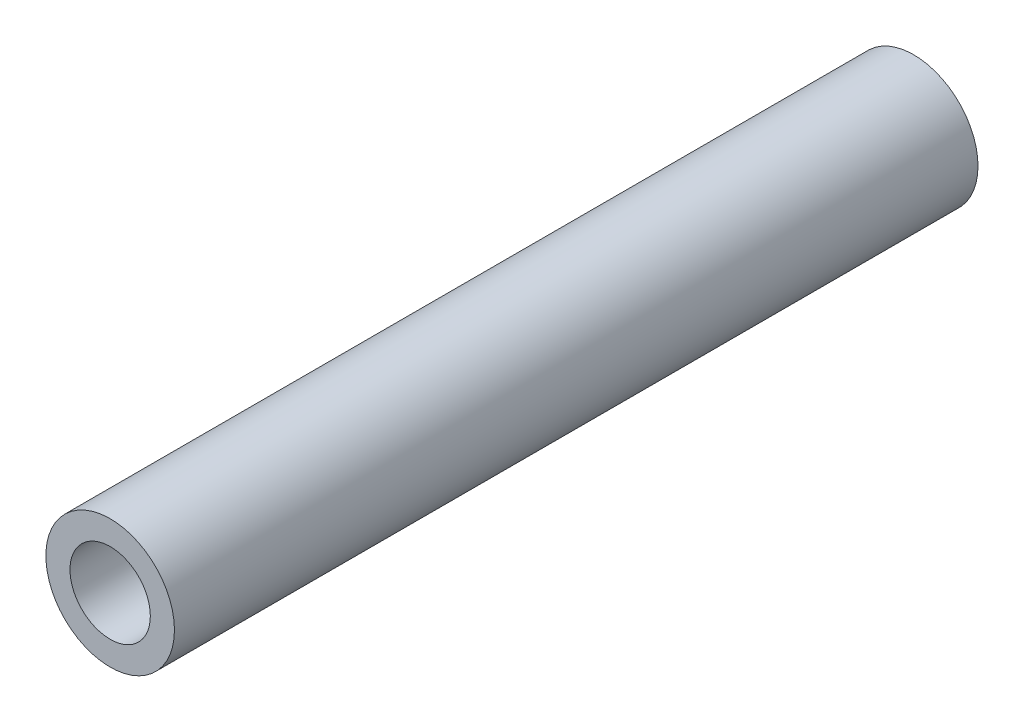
from build123d import *

# Parameters (mm, degrees)
ESQUISSE1_R          = 8
BASE_EXTRUSION_DEPTH = 100


with BuildPart() as part:
    # Esquisse1 → Base-Extrusion (new body)
    with BuildSketch(Plane.XY):
        with Locations((-15, 0)):
            Circle(ESQUISSE1_R)
        with BuildLine():
            ThreePointArc((-10, 0), (-15, 5), (-20, 0))
            ThreePointArc((-20, 0), (-15, -5), (-10, 0))
        make_face(mode=Mode.SUBTRACT)
    extrude(amount=BASE_EXTRUSION_DEPTH)


solid = part.part
